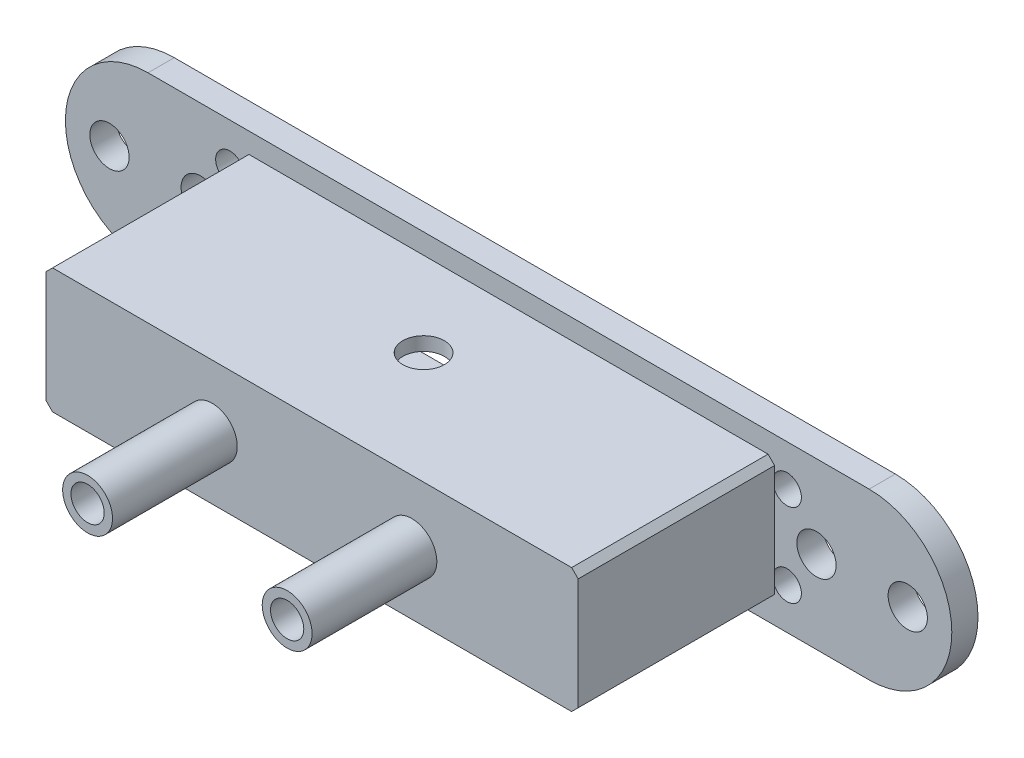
ISO-10303-21;
HEADER;
FILE_DESCRIPTION(('STEP AP214'),'2;1');
FILE_NAME('part.step','',(''),(''),'','','');
FILE_SCHEMA(('AUTOMOTIVE_DESIGN { 1 0 10303 214 1 1 1 1 }'));
ENDSEC;
DATA;
#1=APPLICATION_CONTEXT('core data for automotive mechanical design processes');
#2=APPLICATION_PROTOCOL_DEFINITION('international standard','automotive_design',2000,#1);
#3=PRODUCT_CONTEXT('',#1,'mechanical');
#4=PRODUCT('Part','Part','',(#3));
#5=PRODUCT_RELATED_PRODUCT_CATEGORY('part','',(#4));
#6=PRODUCT_DEFINITION_FORMATION('','',#4);
#7=PRODUCT_DEFINITION_CONTEXT('part definition',#1,'design');
#8=PRODUCT_DEFINITION('design','',#6,#7);
#9=PRODUCT_DEFINITION_SHAPE('','',#8);
#10=(LENGTH_UNIT() NAMED_UNIT(*) SI_UNIT(.MILLI.,.METRE.));
#11=(NAMED_UNIT(*) PLANE_ANGLE_UNIT() SI_UNIT($,.RADIAN.));
#12=(NAMED_UNIT(*) SI_UNIT($,.STERADIAN.) SOLID_ANGLE_UNIT());
#13=UNCERTAINTY_MEASURE_WITH_UNIT(LENGTH_MEASURE(1.E-05),#10,'distance_accuracy_value','');
#14=(GEOMETRIC_REPRESENTATION_CONTEXT(3) GLOBAL_UNCERTAINTY_ASSIGNED_CONTEXT((#13)) GLOBAL_UNIT_ASSIGNED_CONTEXT((#10,
#11,#12)) REPRESENTATION_CONTEXT('',''));
#15=CARTESIAN_POINT('',(0.,0.,0.));
#16=DIRECTION('',(0.,0.,1.));
#17=DIRECTION('',(1.,0.,0.));
#18=AXIS2_PLACEMENT_3D('',#15,#16,#17);
#19=CARTESIAN_POINT('',(-20.32,-4.7625,17.));
#20=DIRECTION('',(0.,0.,1.));
#21=DIRECTION('',(1.,0.,0.));
#22=AXIS2_PLACEMENT_3D('',#19,#20,#21);
#23=PLANE('',#22);
#24=CARTESIAN_POINT('',(7.62,0.,17.));
#25=DIRECTION('',(0.,0.,1.));
#26=DIRECTION('',(1.,0.,0.));
#27=AXIS2_PLACEMENT_3D('',#24,#25,#26);
#28=CIRCLE('',#27,1.905);
#29=CARTESIAN_POINT('',(5.715,0.,17.));
#30=VERTEX_POINT('',#29);
#31=EDGE_CURVE('E459',#30,#30,#28,.T.);
#32=ORIENTED_EDGE('',*,*,#31,.F.);
#33=EDGE_LOOP('',(#32));
#34=FACE_BOUND('',#33,.T.);
#35=DIRECTION('',(0.,-1.,0.));
#36=VECTOR('',#35,1.);
#37=CARTESIAN_POINT('',(-20.32,4.7625,17.));
#38=LINE('',#37,#36);
#39=CARTESIAN_POINT('',(-20.32,4.26250000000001,17.));
#40=VERTEX_POINT('',#39);
#41=CARTESIAN_POINT('',(-20.32,-4.2625,17.));
#42=VERTEX_POINT('',#41);
#43=EDGE_CURVE('E271',#40,#42,#38,.T.);
#44=ORIENTED_EDGE('',*,*,#43,.T.);
#45=DIRECTION('',(-0.707106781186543,0.707106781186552,0.));
#46=VECTOR('',#45,1.);
#47=CARTESIAN_POINT('',(-20.07,-4.5125,17.));
#48=LINE('',#47,#46);
#49=CARTESIAN_POINT('',(-19.82,-4.7625,17.));
#50=VERTEX_POINT('',#49);
#51=EDGE_CURVE('E100',#42,#50,#48,.F.);
#52=ORIENTED_EDGE('',*,*,#51,.T.);
#53=DIRECTION('',(1.,0.,0.));
#54=VECTOR('',#53,1.);
#55=CARTESIAN_POINT('',(-20.32,-4.7625,17.));
#56=LINE('',#55,#54);
#57=CARTESIAN_POINT('',(19.82,-4.7625,17.));
#58=VERTEX_POINT('',#57);
#59=EDGE_CURVE('E274',#50,#58,#56,.T.);
#60=ORIENTED_EDGE('',*,*,#59,.T.);
#61=DIRECTION('',(0.707106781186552,0.707106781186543,0.));
#62=VECTOR('',#61,1.);
#63=CARTESIAN_POINT('',(-0.250000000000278,-24.8325,17.));
#64=LINE('',#63,#62);
#65=CARTESIAN_POINT('',(20.32,-4.2625,17.));
#66=VERTEX_POINT('',#65);
#67=EDGE_CURVE('E366',#58,#66,#64,.T.);
#68=ORIENTED_EDGE('',*,*,#67,.T.);
#69=DIRECTION('',(0.,-1.,0.));
#70=VECTOR('',#69,1.);
#71=CARTESIAN_POINT('',(20.32,4.7625,17.));
#72=LINE('',#71,#70);
#73=CARTESIAN_POINT('',(20.32,4.2625,17.));
#74=VERTEX_POINT('',#73);
#75=EDGE_CURVE('E277',#74,#66,#72,.T.);
#76=ORIENTED_EDGE('',*,*,#75,.F.);
#77=DIRECTION('',(0.707106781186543,-0.707106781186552,0.));
#78=VECTOR('',#77,1.);
#79=CARTESIAN_POINT('',(4.51250000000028,20.0699999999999,17.));
#80=LINE('',#79,#78);
#81=CARTESIAN_POINT('',(19.82,4.7625,17.));
#82=VERTEX_POINT('',#81);
#83=EDGE_CURVE('E356',#74,#82,#80,.F.);
#84=ORIENTED_EDGE('',*,*,#83,.T.);
#85=DIRECTION('',(1.,0.,0.));
#86=VECTOR('',#85,1.);
#87=CARTESIAN_POINT('',(-20.32,4.7625,17.));
#88=LINE('',#87,#86);
#89=CARTESIAN_POINT('',(-19.82,4.7625,17.));
#90=VERTEX_POINT('',#89);
#91=EDGE_CURVE('E279',#90,#82,#88,.T.);
#92=ORIENTED_EDGE('',*,*,#91,.F.);
#93=DIRECTION('',(-0.707106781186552,-0.707106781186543,0.));
#94=VECTOR('',#93,1.);
#95=CARTESIAN_POINT('',(-24.8325,-0.249999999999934,17.));
#96=LINE('',#95,#94);
#97=EDGE_CURVE('E348',#90,#40,#96,.T.);
#98=ORIENTED_EDGE('',*,*,#97,.T.);
#99=EDGE_LOOP('',(#44,#52,#60,#68,#76,#84,#92,#98));
#100=FACE_BOUND('',#99,.T.);
#101=CARTESIAN_POINT('',(-7.62,0.,17.));
#102=DIRECTION('',(0.,0.,1.));
#103=DIRECTION('',(1.,0.,0.));
#104=AXIS2_PLACEMENT_3D('',#101,#102,#103);
#105=CIRCLE('',#104,1.905);
#106=CARTESIAN_POINT('',(-9.525,0.,17.));
#107=VERTEX_POINT('',#106);
#108=EDGE_CURVE('E456',#107,#107,#105,.T.);
#109=ORIENTED_EDGE('',*,*,#108,.F.);
#110=EDGE_LOOP('',(#109));
#111=FACE_BOUND('',#110,.T.);
#112=ADVANCED_FACE('F92',(#34,#100,#111),#23,.T.);
#113=CARTESIAN_POINT('',(-27.5263621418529,0.,0.));
#114=DIRECTION('',(0.,0.,1.));
#115=DIRECTION('',(1.,0.,0.));
#116=AXIS2_PLACEMENT_3D('',#113,#114,#115);
#117=PLANE('',#116);
#118=CARTESIAN_POINT('',(-21.2725,3.175,0.));
#119=DIRECTION('',(0.,0.,1.));
#120=DIRECTION('',(1.,0.,0.));
#121=AXIS2_PLACEMENT_3D('',#118,#119,#120);
#122=CIRCLE('',#121,1.0922);
#123=CARTESIAN_POINT('',(-20.1803,3.175,0.));
#124=VERTEX_POINT('',#123);
#125=EDGE_CURVE('E246',#124,#124,#122,.T.);
#126=ORIENTED_EDGE('',*,*,#125,.T.);
#127=EDGE_LOOP('',(#126));
#128=FACE_BOUND('',#127,.T.);
#129=CARTESIAN_POINT('',(-21.2725,-3.175,0.));
#130=DIRECTION('',(0.,0.,1.));
#131=DIRECTION('',(1.,0.,0.));
#132=AXIS2_PLACEMENT_3D('',#129,#130,#131);
#133=CIRCLE('',#132,1.0922);
#134=CARTESIAN_POINT('',(-20.1803,-3.175,0.));
#135=VERTEX_POINT('',#134);
#136=EDGE_CURVE('E844',#135,#135,#133,.T.);
#137=ORIENTED_EDGE('',*,*,#136,.T.);
#138=EDGE_LOOP('',(#137));
#139=FACE_BOUND('',#138,.T.);
#140=CARTESIAN_POINT('',(21.2725,3.175,0.));
#141=DIRECTION('',(0.,0.,1.));
#142=DIRECTION('',(1.,0.,0.));
#143=AXIS2_PLACEMENT_3D('',#140,#141,#142);
#144=CIRCLE('',#143,1.0922);
#145=CARTESIAN_POINT('',(22.3647,3.175,0.));
#146=VERTEX_POINT('',#145);
#147=EDGE_CURVE('E429',#146,#146,#144,.T.);
#148=ORIENTED_EDGE('',*,*,#147,.T.);
#149=EDGE_LOOP('',(#148));
#150=FACE_BOUND('',#149,.T.);
#151=CARTESIAN_POINT('',(21.2725,-3.175,0.));
#152=DIRECTION('',(0.,0.,1.));
#153=DIRECTION('',(1.,0.,0.));
#154=AXIS2_PLACEMENT_3D('',#151,#152,#153);
#155=CIRCLE('',#154,1.0922);
#156=CARTESIAN_POINT('',(22.3647,-3.175,0.));
#157=VERTEX_POINT('',#156);
#158=EDGE_CURVE('E427',#157,#157,#155,.T.);
#159=ORIENTED_EDGE('',*,*,#158,.T.);
#160=EDGE_LOOP('',(#159));
#161=FACE_BOUND('',#160,.T.);
#162=CARTESIAN_POINT('',(30.4872378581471,0.,0.));
#163=DIRECTION('',(0.,0.,1.));
#164=DIRECTION('',(1.,0.,0.));
#165=AXIS2_PLACEMENT_3D('',#162,#163,#164);
#166=CIRCLE('',#165,1.50000000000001);
#167=CARTESIAN_POINT('',(31.9872378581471,0.,0.));
#168=VERTEX_POINT('',#167);
#169=EDGE_CURVE('E281',#168,#168,#166,.T.);
#170=ORIENTED_EDGE('',*,*,#169,.T.);
#171=EDGE_LOOP('',(#170));
#172=FACE_BOUND('',#171,.T.);
#173=CARTESIAN_POINT('',(-30.4727621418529,0.,0.));
#174=DIRECTION('',(0.,0.,-1.));
#175=DIRECTION('',(-1.,0.,0.));
#176=AXIS2_PLACEMENT_3D('',#173,#174,#175);
#177=CIRCLE('',#176,1.5);
#178=CARTESIAN_POINT('',(-31.9727621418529,0.,0.));
#179=VERTEX_POINT('',#178);
#180=EDGE_CURVE('E292',#179,#179,#177,.T.);
#181=ORIENTED_EDGE('',*,*,#180,.F.);
#182=EDGE_LOOP('',(#181));
#183=FACE_BOUND('',#182,.T.);
#184=CARTESIAN_POINT('',(-23.5059242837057,0.,0.));
#185=DIRECTION('',(0.,0.,1.));
#186=DIRECTION('',(1.,0.,0.));
#187=AXIS2_PLACEMENT_3D('',#184,#185,#186);
#188=CIRCLE('',#187,1.5);
#189=CARTESIAN_POINT('',(-22.0059242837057,0.,0.));
#190=VERTEX_POINT('',#189);
#191=EDGE_CURVE('E305',#190,#190,#188,.T.);
#192=ORIENTED_EDGE('',*,*,#191,.T.);
#193=EDGE_LOOP('',(#192));
#194=FACE_BOUND('',#193,.T.);
#195=CARTESIAN_POINT('',(-27.5263621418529,0.,0.));
#196=DIRECTION('',(0.,0.,1.));
#197=DIRECTION('',(1.,0.,0.));
#198=AXIS2_PLACEMENT_3D('',#195,#196,#197);
#199=CIRCLE('',#198,6.3119);
#200=CARTESIAN_POINT('',(-27.5263621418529,6.3119,0.));
#201=VERTEX_POINT('',#200);
#202=CARTESIAN_POINT('',(-27.5263621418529,-6.3119,0.));
#203=VERTEX_POINT('',#202);
#204=EDGE_CURVE('E311',#201,#203,#199,.T.);
#205=ORIENTED_EDGE('',*,*,#204,.F.);
#206=DIRECTION('',(1.,0.,0.));
#207=VECTOR('',#206,1.);
#208=CARTESIAN_POINT('',(-27.5263621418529,6.3119,0.));
#209=LINE('',#208,#207);
#210=CARTESIAN_POINT('',(27.5408371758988,6.3119,0.));
#211=VERTEX_POINT('',#210);
#212=EDGE_CURVE('E318',#201,#211,#209,.T.);
#213=ORIENTED_EDGE('',*,*,#212,.T.);
#214=CARTESIAN_POINT('',(27.5408378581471,0.,0.));
#215=DIRECTION('',(0.,0.,-1.));
#216=DIRECTION('',(-1.,0.,0.));
#217=AXIS2_PLACEMENT_3D('',#214,#215,#216);
#218=CIRCLE('',#217,6.31190000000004);
#219=CARTESIAN_POINT('',(27.5408385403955,-6.3119,0.));
#220=VERTEX_POINT('',#219);
#221=EDGE_CURVE('E332',#211,#220,#218,.T.);
#222=ORIENTED_EDGE('',*,*,#221,.T.);
#223=DIRECTION('',(1.,0.,0.));
#224=VECTOR('',#223,1.);
#225=CARTESIAN_POINT('',(-27.5263621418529,-6.3119,0.));
#226=LINE('',#225,#224);
#227=EDGE_CURVE('E329',#203,#220,#226,.T.);
#228=ORIENTED_EDGE('',*,*,#227,.F.);
#229=EDGE_LOOP('',(#205,#213,#222,#228));
#230=FACE_BOUND('',#229,.T.);
#231=CARTESIAN_POINT('',(23.5204,0.,0.));
#232=DIRECTION('',(0.,0.,1.));
#233=DIRECTION('',(1.,0.,0.));
#234=AXIS2_PLACEMENT_3D('',#231,#232,#233);
#235=CIRCLE('',#234,1.5);
#236=CARTESIAN_POINT('',(25.0204,0.,0.));
#237=VERTEX_POINT('',#236);
#238=EDGE_CURVE('E299',#237,#237,#235,.T.);
#239=ORIENTED_EDGE('',*,*,#238,.T.);
#240=EDGE_LOOP('',(#239));
#241=FACE_BOUND('',#240,.T.);
#242=DIRECTION('',(1.,0.,0.));
#243=VECTOR('',#242,1.);
#244=CARTESIAN_POINT('',(-20.32,3.7211,0.));
#245=LINE('',#244,#243);
#246=CARTESIAN_POINT('',(-19.2786,3.7211,0.));
#247=VERTEX_POINT('',#246);
#248=CARTESIAN_POINT('',(19.2786,3.7211,0.));
#249=VERTEX_POINT('',#248);
#250=EDGE_CURVE('E474',#247,#249,#245,.T.);
#251=ORIENTED_EDGE('',*,*,#250,.F.);
#252=DIRECTION('',(0.,-1.,0.));
#253=VECTOR('',#252,1.);
#254=CARTESIAN_POINT('',(-19.2786,4.7625,0.));
#255=LINE('',#254,#253);
#256=CARTESIAN_POINT('',(-19.2786,-3.7211,0.));
#257=VERTEX_POINT('',#256);
#258=EDGE_CURVE('E465',#247,#257,#255,.T.);
#259=ORIENTED_EDGE('',*,*,#258,.T.);
#260=DIRECTION('',(1.,0.,0.));
#261=VECTOR('',#260,1.);
#262=CARTESIAN_POINT('',(-20.32,-3.7211,0.));
#263=LINE('',#262,#261);
#264=CARTESIAN_POINT('',(19.2786,-3.7211,0.));
#265=VERTEX_POINT('',#264);
#266=EDGE_CURVE('E468',#257,#265,#263,.T.);
#267=ORIENTED_EDGE('',*,*,#266,.T.);
#268=DIRECTION('',(0.,-1.,0.));
#269=VECTOR('',#268,1.);
#270=CARTESIAN_POINT('',(19.2786,4.7625,0.));
#271=LINE('',#270,#269);
#272=EDGE_CURVE('E471',#249,#265,#271,.T.);
#273=ORIENTED_EDGE('',*,*,#272,.F.);
#274=EDGE_LOOP('',(#251,#259,#267,#273));
#275=FACE_BOUND('',#274,.T.);
#276=ADVANCED_FACE('F507',(#128,#139,#150,#161,#172,#183,#194,#230,#241,#275),#117,.F.);
#277=CARTESIAN_POINT('',(-27.5263621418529,0.,2.));
#278=DIRECTION('',(0.,0.,1.));
#279=DIRECTION('',(1.,0.,0.));
#280=AXIS2_PLACEMENT_3D('',#277,#278,#279);
#281=PLANE('',#280);
#282=CARTESIAN_POINT('',(-21.2725,3.175,2.));
#283=DIRECTION('',(0.,0.,1.));
#284=DIRECTION('',(1.,0.,0.));
#285=AXIS2_PLACEMENT_3D('',#282,#283,#284);
#286=CIRCLE('',#285,1.09219999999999);
#287=CARTESIAN_POINT('',(-20.32,3.7094572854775,2.));
#288=VERTEX_POINT('',#287);
#289=CARTESIAN_POINT('',(-20.32,2.64054271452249,2.));
#290=VERTEX_POINT('',#289);
#291=EDGE_CURVE('E106',#288,#290,#286,.T.);
#292=ORIENTED_EDGE('',*,*,#291,.F.);
#293=DIRECTION('',(0.,-1.,0.));
#294=VECTOR('',#293,1.);
#295=CARTESIAN_POINT('',(-20.32,4.7625,2.));
#296=LINE('',#295,#294);
#297=CARTESIAN_POINT('',(-20.32,4.26250000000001,2.));
#298=VERTEX_POINT('',#297);
#299=EDGE_CURVE('E236',#298,#288,#296,.T.);
#300=ORIENTED_EDGE('',*,*,#299,.F.);
#301=DIRECTION('',(0.707106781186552,0.707106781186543,0.));
#302=VECTOR('',#301,1.);
#303=CARTESIAN_POINT('',(-20.32,4.26250000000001,2.));
#304=LINE('',#303,#302);
#305=CARTESIAN_POINT('',(-19.82,4.7625,2.));
#306=VERTEX_POINT('',#305);
#307=EDGE_CURVE('E350',#298,#306,#304,.T.);
#308=ORIENTED_EDGE('',*,*,#307,.T.);
#309=DIRECTION('',(1.,0.,0.));
#310=VECTOR('',#309,1.);
#311=CARTESIAN_POINT('',(-20.32,4.7625,2.));
#312=LINE('',#311,#310);
#313=CARTESIAN_POINT('',(19.82,4.7625,2.));
#314=VERTEX_POINT('',#313);
#315=EDGE_CURVE('E275',#306,#314,#312,.T.);
#316=ORIENTED_EDGE('',*,*,#315,.T.);
#317=DIRECTION('',(-0.707106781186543,0.707106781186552,0.));
#318=VECTOR('',#317,1.);
#319=CARTESIAN_POINT('',(19.82,4.7625,2.));
#320=LINE('',#319,#318);
#321=CARTESIAN_POINT('',(20.32,4.2625,2.));
#322=VERTEX_POINT('',#321);
#323=EDGE_CURVE('E358',#314,#322,#320,.F.);
#324=ORIENTED_EDGE('',*,*,#323,.T.);
#325=DIRECTION('',(0.,-1.,0.));
#326=VECTOR('',#325,1.);
#327=CARTESIAN_POINT('',(20.32,4.7625,2.));
#328=LINE('',#327,#326);
#329=CARTESIAN_POINT('',(20.32,3.7094572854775,2.));
#330=VERTEX_POINT('',#329);
#331=EDGE_CURVE('E401',#322,#330,#328,.T.);
#332=ORIENTED_EDGE('',*,*,#331,.T.);
#333=CARTESIAN_POINT('',(21.2725,3.175,2.));
#334=DIRECTION('',(0.,0.,1.));
#335=DIRECTION('',(1.,0.,0.));
#336=AXIS2_PLACEMENT_3D('',#333,#334,#335);
#337=CIRCLE('',#336,1.09219999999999);
#338=CARTESIAN_POINT('',(20.32,2.64054271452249,2.));
#339=VERTEX_POINT('',#338);
#340=EDGE_CURVE('E846',#339,#330,#337,.T.);
#341=ORIENTED_EDGE('',*,*,#340,.F.);
#342=CARTESIAN_POINT('',(20.32,-2.6405427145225,2.));
#343=VERTEX_POINT('',#342);
#344=EDGE_CURVE('E413',#339,#343,#328,.T.);
#345=ORIENTED_EDGE('',*,*,#344,.T.);
#346=CARTESIAN_POINT('',(21.2725,-3.175,2.));
#347=DIRECTION('',(0.,0.,1.));
#348=DIRECTION('',(1.,0.,0.));
#349=AXIS2_PLACEMENT_3D('',#346,#347,#348);
#350=CIRCLE('',#349,1.09219999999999);
#351=CARTESIAN_POINT('',(20.32,-3.70945728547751,2.));
#352=VERTEX_POINT('',#351);
#353=EDGE_CURVE('E426',#352,#343,#350,.T.);
#354=ORIENTED_EDGE('',*,*,#353,.F.);
#355=CARTESIAN_POINT('',(20.32,-4.2625,2.));
#356=VERTEX_POINT('',#355);
#357=EDGE_CURVE('E254',#352,#356,#328,.T.);
#358=ORIENTED_EDGE('',*,*,#357,.T.);
#359=DIRECTION('',(-0.707106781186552,-0.707106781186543,0.));
#360=VECTOR('',#359,1.);
#361=CARTESIAN_POINT('',(20.32,-4.26250000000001,2.));
#362=LINE('',#361,#360);
#363=CARTESIAN_POINT('',(19.82,-4.7625,2.));
#364=VERTEX_POINT('',#363);
#365=EDGE_CURVE('E368',#356,#364,#362,.T.);
#366=ORIENTED_EDGE('',*,*,#365,.T.);
#367=DIRECTION('',(1.,0.,0.));
#368=VECTOR('',#367,1.);
#369=CARTESIAN_POINT('',(-20.32,-4.7625,2.));
#370=LINE('',#369,#368);
#371=CARTESIAN_POINT('',(-19.82,-4.7625,2.));
#372=VERTEX_POINT('',#371);
#373=EDGE_CURVE('E252',#372,#364,#370,.T.);
#374=ORIENTED_EDGE('',*,*,#373,.F.);
#375=DIRECTION('',(0.707106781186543,-0.707106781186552,0.));
#376=VECTOR('',#375,1.);
#377=CARTESIAN_POINT('',(-19.82,-4.7625,2.));
#378=LINE('',#377,#376);
#379=CARTESIAN_POINT('',(-20.32,-4.2625,2.));
#380=VERTEX_POINT('',#379);
#381=EDGE_CURVE('E12',#372,#380,#378,.F.);
#382=ORIENTED_EDGE('',*,*,#381,.T.);
#383=CARTESIAN_POINT('',(-20.32,-3.70945728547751,2.));
#384=VERTEX_POINT('',#383);
#385=EDGE_CURVE('E239',#384,#380,#296,.T.);
#386=ORIENTED_EDGE('',*,*,#385,.F.);
#387=CARTESIAN_POINT('',(-21.2725,-3.175,2.));
#388=DIRECTION('',(0.,0.,1.));
#389=DIRECTION('',(1.,0.,0.));
#390=AXIS2_PLACEMENT_3D('',#387,#388,#389);
#391=CIRCLE('',#390,1.09219999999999);
#392=CARTESIAN_POINT('',(-20.32,-2.6405427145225,2.));
#393=VERTEX_POINT('',#392);
#394=EDGE_CURVE('E113',#393,#384,#391,.T.);
#395=ORIENTED_EDGE('',*,*,#394,.F.);
#396=EDGE_CURVE('E237',#290,#393,#296,.T.);
#397=ORIENTED_EDGE('',*,*,#396,.F.);
#398=EDGE_LOOP('',(#292,#300,#308,#316,#324,#332,#341,#345,#354,#358,#366,#374,#382,#386,#395,#397));
#399=FACE_BOUND('',#398,.T.);
#400=CARTESIAN_POINT('',(30.4872378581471,0.,2.));
#401=DIRECTION('',(0.,0.,1.));
#402=DIRECTION('',(1.,0.,0.));
#403=AXIS2_PLACEMENT_3D('',#400,#401,#402);
#404=CIRCLE('',#403,1.50000000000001);
#405=CARTESIAN_POINT('',(31.9872378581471,0.,2.));
#406=VERTEX_POINT('',#405);
#407=EDGE_CURVE('E287',#406,#406,#404,.T.);
#408=ORIENTED_EDGE('',*,*,#407,.F.);
#409=EDGE_LOOP('',(#408));
#410=FACE_BOUND('',#409,.T.);
#411=CARTESIAN_POINT('',(-30.4727621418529,0.,2.));
#412=DIRECTION('',(0.,0.,-1.));
#413=DIRECTION('',(-1.,0.,0.));
#414=AXIS2_PLACEMENT_3D('',#411,#412,#413);
#415=CIRCLE('',#414,1.5);
#416=CARTESIAN_POINT('',(-31.9727621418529,0.,2.));
#417=VERTEX_POINT('',#416);
#418=EDGE_CURVE('E296',#417,#417,#415,.T.);
#419=ORIENTED_EDGE('',*,*,#418,.T.);
#420=EDGE_LOOP('',(#419));
#421=FACE_BOUND('',#420,.T.);
#422=CARTESIAN_POINT('',(-23.5059242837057,0.,2.));
#423=DIRECTION('',(0.,0.,1.));
#424=DIRECTION('',(1.,0.,0.));
#425=AXIS2_PLACEMENT_3D('',#422,#423,#424);
#426=CIRCLE('',#425,1.5);
#427=CARTESIAN_POINT('',(-22.0059242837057,0.,2.));
#428=VERTEX_POINT('',#427);
#429=EDGE_CURVE('E308',#428,#428,#426,.T.);
#430=ORIENTED_EDGE('',*,*,#429,.F.);
#431=EDGE_LOOP('',(#430));
#432=FACE_BOUND('',#431,.T.);
#433=CARTESIAN_POINT('',(-27.5263621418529,0.,2.));
#434=DIRECTION('',(0.,0.,1.));
#435=DIRECTION('',(1.,0.,0.));
#436=AXIS2_PLACEMENT_3D('',#433,#434,#435);
#437=CIRCLE('',#436,6.3119);
#438=CARTESIAN_POINT('',(-27.5263621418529,6.3119,2.));
#439=VERTEX_POINT('',#438);
#440=CARTESIAN_POINT('',(-27.5263621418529,-6.3119,2.));
#441=VERTEX_POINT('',#440);
#442=EDGE_CURVE('E314',#439,#441,#437,.T.);
#443=ORIENTED_EDGE('',*,*,#442,.T.);
#444=DIRECTION('',(1.,0.,0.));
#445=VECTOR('',#444,1.);
#446=CARTESIAN_POINT('',(-27.5263621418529,-6.3119,2.));
#447=LINE('',#446,#445);
#448=CARTESIAN_POINT('',(27.5408385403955,-6.3119,2.));
#449=VERTEX_POINT('',#448);
#450=EDGE_CURVE('E317',#441,#449,#447,.T.);
#451=ORIENTED_EDGE('',*,*,#450,.T.);
#452=CARTESIAN_POINT('',(27.5408378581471,0.,2.));
#453=DIRECTION('',(0.,0.,-1.));
#454=DIRECTION('',(-1.,0.,0.));
#455=AXIS2_PLACEMENT_3D('',#452,#453,#454);
#456=CIRCLE('',#455,6.31190000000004);
#457=CARTESIAN_POINT('',(27.5408371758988,6.3119,2.));
#458=VERTEX_POINT('',#457);
#459=EDGE_CURVE('E320',#458,#449,#456,.T.);
#460=ORIENTED_EDGE('',*,*,#459,.F.);
#461=DIRECTION('',(1.,0.,0.));
#462=VECTOR('',#461,1.);
#463=CARTESIAN_POINT('',(-27.5263621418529,6.3119,2.));
#464=LINE('',#463,#462);
#465=EDGE_CURVE('E323',#439,#458,#464,.T.);
#466=ORIENTED_EDGE('',*,*,#465,.F.);
#467=EDGE_LOOP('',(#443,#451,#460,#466));
#468=FACE_BOUND('',#467,.T.);
#469=CARTESIAN_POINT('',(23.5204,0.,2.));
#470=DIRECTION('',(0.,0.,1.));
#471=DIRECTION('',(1.,0.,0.));
#472=AXIS2_PLACEMENT_3D('',#469,#470,#471);
#473=CIRCLE('',#472,1.5);
#474=CARTESIAN_POINT('',(25.0204,0.,2.));
#475=VERTEX_POINT('',#474);
#476=EDGE_CURVE('E302',#475,#475,#473,.T.);
#477=ORIENTED_EDGE('',*,*,#476,.F.);
#478=EDGE_LOOP('',(#477));
#479=FACE_BOUND('',#478,.T.);
#480=ADVANCED_FACE('F244',(#399,#410,#421,#432,#468,#479),#281,.T.);
#481=CARTESIAN_POINT('',(-27.5263621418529,0.,2.));
#482=DIRECTION('',(0.,0.,-1.));
#483=DIRECTION('',(-1.,0.,0.));
#484=AXIS2_PLACEMENT_3D('',#481,#482,#483);
#485=CYLINDRICAL_SURFACE('',#484,6.3119);
#486=ORIENTED_EDGE('',*,*,#204,.T.);
#487=DIRECTION('',(0.,0.,-1.));
#488=VECTOR('',#487,1.);
#489=CARTESIAN_POINT('',(-27.5263621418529,-6.3119,2.));
#490=LINE('',#489,#488);
#491=EDGE_CURVE('E342',#441,#203,#490,.T.);
#492=ORIENTED_EDGE('',*,*,#491,.F.);
#493=ORIENTED_EDGE('',*,*,#442,.F.);
#494=DIRECTION('',(0.,0.,-1.));
#495=VECTOR('',#494,1.);
#496=CARTESIAN_POINT('',(-27.5263621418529,6.3119,2.));
#497=LINE('',#496,#495);
#498=EDGE_CURVE('E326',#439,#201,#497,.T.);
#499=ORIENTED_EDGE('',*,*,#498,.T.);
#500=EDGE_LOOP('',(#486,#492,#493,#499));
#501=FACE_BOUND('',#500,.T.);
#502=ADVANCED_FACE('F515',(#501),#485,.T.);
#503=CARTESIAN_POINT('',(-27.5263621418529,-6.3119,2.));
#504=DIRECTION('',(0.,1.,0.));
#505=DIRECTION('',(0.,0.,1.));
#506=AXIS2_PLACEMENT_3D('',#503,#504,#505);
#507=PLANE('',#506);
#508=ORIENTED_EDGE('',*,*,#227,.T.);
#509=DIRECTION('',(0.,0.,-1.));
#510=VECTOR('',#509,1.);
#511=CARTESIAN_POINT('',(27.5408385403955,-6.3119,2.));
#512=LINE('',#511,#510);
#513=EDGE_CURVE('E340',#449,#220,#512,.T.);
#514=ORIENTED_EDGE('',*,*,#513,.F.);
#515=ORIENTED_EDGE('',*,*,#450,.F.);
#516=ORIENTED_EDGE('',*,*,#491,.T.);
#517=EDGE_LOOP('',(#508,#514,#515,#516));
#518=FACE_BOUND('',#517,.T.);
#519=ADVANCED_FACE('F531',(#518),#507,.F.);
#520=CARTESIAN_POINT('',(27.5408378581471,0.,2.));
#521=DIRECTION('',(0.,0.,-1.));
#522=DIRECTION('',(-1.,0.,0.));
#523=AXIS2_PLACEMENT_3D('',#520,#521,#522);
#524=CYLINDRICAL_SURFACE('',#523,6.31190000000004);
#525=ORIENTED_EDGE('',*,*,#221,.F.);
#526=DIRECTION('',(0.,0.,-1.));
#527=VECTOR('',#526,1.);
#528=CARTESIAN_POINT('',(27.5408371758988,6.3119,2.));
#529=LINE('',#528,#527);
#530=EDGE_CURVE('E338',#458,#211,#529,.T.);
#531=ORIENTED_EDGE('',*,*,#530,.F.);
#532=ORIENTED_EDGE('',*,*,#459,.T.);
#533=ORIENTED_EDGE('',*,*,#513,.T.);
#534=EDGE_LOOP('',(#525,#531,#532,#533));
#535=FACE_BOUND('',#534,.T.);
#536=ADVANCED_FACE('F527',(#535),#524,.T.);
#537=CARTESIAN_POINT('',(-27.5263621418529,6.3119,2.));
#538=DIRECTION('',(0.,1.,0.));
#539=DIRECTION('',(0.,0.,1.));
#540=AXIS2_PLACEMENT_3D('',#537,#538,#539);
#541=PLANE('',#540);
#542=ORIENTED_EDGE('',*,*,#212,.F.);
#543=ORIENTED_EDGE('',*,*,#498,.F.);
#544=ORIENTED_EDGE('',*,*,#465,.T.);
#545=ORIENTED_EDGE('',*,*,#530,.T.);
#546=EDGE_LOOP('',(#542,#543,#544,#545));
#547=FACE_BOUND('',#546,.T.);
#548=ADVANCED_FACE('F523',(#547),#541,.T.);
#549=CARTESIAN_POINT('',(-23.5059242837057,0.,2.));
#550=DIRECTION('',(0.,0.,-1.));
#551=DIRECTION('',(-1.,0.,0.));
#552=AXIS2_PLACEMENT_3D('',#549,#550,#551);
#553=CYLINDRICAL_SURFACE('',#552,1.5);
#554=ORIENTED_EDGE('',*,*,#429,.T.);
#555=EDGE_LOOP('',(#554));
#556=FACE_BOUND('',#555,.T.);
#557=ORIENTED_EDGE('',*,*,#191,.F.);
#558=EDGE_LOOP('',(#557));
#559=FACE_BOUND('',#558,.T.);
#560=ADVANCED_FACE('F526',(#556,#559),#553,.F.);
#561=CARTESIAN_POINT('',(23.5204,0.,2.));
#562=DIRECTION('',(0.,0.,-1.));
#563=DIRECTION('',(-1.,0.,0.));
#564=AXIS2_PLACEMENT_3D('',#561,#562,#563);
#565=CYLINDRICAL_SURFACE('',#564,1.5);
#566=ORIENTED_EDGE('',*,*,#476,.T.);
#567=EDGE_LOOP('',(#566));
#568=FACE_BOUND('',#567,.T.);
#569=ORIENTED_EDGE('',*,*,#238,.F.);
#570=EDGE_LOOP('',(#569));
#571=FACE_BOUND('',#570,.T.);
#572=ADVANCED_FACE('F582',(#568,#571),#565,.F.);
#573=CARTESIAN_POINT('',(-30.4727621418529,0.,2.));
#574=DIRECTION('',(0.,0.,-1.));
#575=DIRECTION('',(-1.,0.,0.));
#576=AXIS2_PLACEMENT_3D('',#573,#574,#575);
#577=CYLINDRICAL_SURFACE('',#576,1.5);
#578=ORIENTED_EDGE('',*,*,#418,.F.);
#579=EDGE_LOOP('',(#578));
#580=FACE_BOUND('',#579,.T.);
#581=ORIENTED_EDGE('',*,*,#180,.T.);
#582=EDGE_LOOP('',(#581));
#583=FACE_BOUND('',#582,.T.);
#584=ADVANCED_FACE('F578',(#580,#583),#577,.F.);
#585=CARTESIAN_POINT('',(30.4872378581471,0.,2.));
#586=DIRECTION('',(0.,0.,-1.));
#587=DIRECTION('',(-1.,0.,0.));
#588=AXIS2_PLACEMENT_3D('',#585,#586,#587);
#589=CYLINDRICAL_SURFACE('',#588,1.50000000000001);
#590=ORIENTED_EDGE('',*,*,#407,.T.);
#591=EDGE_LOOP('',(#590));
#592=FACE_BOUND('',#591,.T.);
#593=ORIENTED_EDGE('',*,*,#169,.F.);
#594=EDGE_LOOP('',(#593));
#595=FACE_BOUND('',#594,.T.);
#596=ADVANCED_FACE('F575',(#592,#595),#589,.F.);
#597=CARTESIAN_POINT('',(-20.32,4.7625,17.));
#598=DIRECTION('',(1.,0.,0.));
#599=DIRECTION('',(0.,0.,-1.));
#600=AXIS2_PLACEMENT_3D('',#597,#598,#599);
#601=PLANE('',#600);
#602=ORIENTED_EDGE('',*,*,#299,.T.);
#603=EDGE_CURVE('E230',#288,#290,#296,.T.);
#604=ORIENTED_EDGE('',*,*,#603,.T.);
#605=ORIENTED_EDGE('',*,*,#396,.T.);
#606=EDGE_CURVE('E253',#393,#384,#296,.T.);
#607=ORIENTED_EDGE('',*,*,#606,.T.);
#608=ORIENTED_EDGE('',*,*,#385,.T.);
#609=DIRECTION('',(0.,0.,1.));
#610=VECTOR('',#609,1.);
#611=CARTESIAN_POINT('',(-20.32,-4.2625,17.));
#612=LINE('',#611,#610);
#613=EDGE_CURVE('E374',#380,#42,#612,.T.);
#614=ORIENTED_EDGE('',*,*,#613,.T.);
#615=ORIENTED_EDGE('',*,*,#43,.F.);
#616=DIRECTION('',(0.,0.,-1.));
#617=VECTOR('',#616,1.);
#618=CARTESIAN_POINT('',(-20.32,4.26250000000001,2.));
#619=LINE('',#618,#617);
#620=EDGE_CURVE('E251',#40,#298,#619,.T.);
#621=ORIENTED_EDGE('',*,*,#620,.T.);
#622=EDGE_LOOP('',(#602,#604,#605,#607,#608,#614,#615,#621));
#623=FACE_BOUND('',#622,.T.);
#624=ADVANCED_FACE('F248',(#623),#601,.F.);
#625=CARTESIAN_POINT('',(-20.32,-4.7625,17.));
#626=DIRECTION('',(0.,1.,0.));
#627=DIRECTION('',(0.,0.,1.));
#628=AXIS2_PLACEMENT_3D('',#625,#626,#627);
#629=PLANE('',#628);
#630=ORIENTED_EDGE('',*,*,#59,.F.);
#631=DIRECTION('',(0.,0.,-1.));
#632=VECTOR('',#631,1.);
#633=CARTESIAN_POINT('',(-19.82,-4.7625,17.));
#634=LINE('',#633,#632);
#635=EDGE_CURVE('E371',#50,#372,#634,.T.);
#636=ORIENTED_EDGE('',*,*,#635,.T.);
#637=ORIENTED_EDGE('',*,*,#373,.T.);
#638=DIRECTION('',(0.,0.,1.));
#639=VECTOR('',#638,1.);
#640=CARTESIAN_POINT('',(19.82,-4.7625,17.));
#641=LINE('',#640,#639);
#642=EDGE_CURVE('E363',#364,#58,#641,.T.);
#643=ORIENTED_EDGE('',*,*,#642,.T.);
#644=EDGE_LOOP('',(#630,#636,#637,#643));
#645=FACE_BOUND('',#644,.T.);
#646=ADVANCED_FACE('F383',(#645),#629,.F.);
#647=CARTESIAN_POINT('',(20.32,4.7625,17.));
#648=DIRECTION('',(1.,0.,0.));
#649=DIRECTION('',(0.,0.,-1.));
#650=AXIS2_PLACEMENT_3D('',#647,#648,#649);
#651=PLANE('',#650);
#652=ORIENTED_EDGE('',*,*,#75,.T.);
#653=DIRECTION('',(0.,0.,-1.));
#654=VECTOR('',#653,1.);
#655=CARTESIAN_POINT('',(20.32,-4.26250000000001,2.));
#656=LINE('',#655,#654);
#657=EDGE_CURVE('E360',#66,#356,#656,.T.);
#658=ORIENTED_EDGE('',*,*,#657,.T.);
#659=ORIENTED_EDGE('',*,*,#357,.F.);
#660=EDGE_CURVE('E414',#343,#352,#328,.T.);
#661=ORIENTED_EDGE('',*,*,#660,.F.);
#662=ORIENTED_EDGE('',*,*,#344,.F.);
#663=EDGE_CURVE('E411',#330,#339,#328,.T.);
#664=ORIENTED_EDGE('',*,*,#663,.F.);
#665=ORIENTED_EDGE('',*,*,#331,.F.);
#666=DIRECTION('',(0.,0.,1.));
#667=VECTOR('',#666,1.);
#668=CARTESIAN_POINT('',(20.32,4.2625,17.));
#669=LINE('',#668,#667);
#670=EDGE_CURVE('E354',#322,#74,#669,.T.);
#671=ORIENTED_EDGE('',*,*,#670,.T.);
#672=EDGE_LOOP('',(#652,#658,#659,#661,#662,#664,#665,#671));
#673=FACE_BOUND('',#672,.T.);
#674=ADVANCED_FACE('F396',(#673),#651,.T.);
#675=CARTESIAN_POINT('',(-20.32,4.7625,17.));
#676=DIRECTION('',(0.,1.,0.));
#677=DIRECTION('',(0.,0.,1.));
#678=AXIS2_PLACEMENT_3D('',#675,#676,#677);
#679=PLANE('',#678);
#680=CARTESIAN_POINT('',(-0.0457049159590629,4.7625,8.44091814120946));
#681=DIRECTION('',(0.,1.,0.));
#682=DIRECTION('',(0.,0.,1.));
#683=AXIS2_PLACEMENT_3D('',#680,#681,#682);
#684=CIRCLE('',#683,1.5875);
#685=CARTESIAN_POINT('',(-0.0457049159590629,4.7625,10.0284181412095));
#686=VERTEX_POINT('',#685);
#687=EDGE_CURVE('E437',#686,#686,#684,.T.);
#688=ORIENTED_EDGE('',*,*,#687,.F.);
#689=EDGE_LOOP('',(#688));
#690=FACE_BOUND('',#689,.T.);
#691=ORIENTED_EDGE('',*,*,#91,.T.);
#692=DIRECTION('',(0.,0.,-1.));
#693=VECTOR('',#692,1.);
#694=CARTESIAN_POINT('',(19.82,4.7625,17.));
#695=LINE('',#694,#693);
#696=EDGE_CURVE('E352',#82,#314,#695,.T.);
#697=ORIENTED_EDGE('',*,*,#696,.T.);
#698=ORIENTED_EDGE('',*,*,#315,.F.);
#699=DIRECTION('',(0.,0.,1.));
#700=VECTOR('',#699,1.);
#701=CARTESIAN_POINT('',(-19.82,4.7625,17.));
#702=LINE('',#701,#700);
#703=EDGE_CURVE('E346',#306,#90,#702,.T.);
#704=ORIENTED_EDGE('',*,*,#703,.T.);
#705=EDGE_LOOP('',(#691,#697,#698,#704));
#706=FACE_BOUND('',#705,.T.);
#707=ADVANCED_FACE('F410',(#690,#706),#679,.T.);
#708=CARTESIAN_POINT('',(-20.32,4.26250000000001,17.));
#709=DIRECTION('',(-0.707106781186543,0.707106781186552,0.));
#710=DIRECTION('',(-0.707106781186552,-0.707106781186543,0.));
#711=AXIS2_PLACEMENT_3D('',#708,#709,#710);
#712=PLANE('',#711);
#713=ORIENTED_EDGE('',*,*,#97,.F.);
#714=ORIENTED_EDGE('',*,*,#703,.F.);
#715=ORIENTED_EDGE('',*,*,#307,.F.);
#716=ORIENTED_EDGE('',*,*,#620,.F.);
#717=EDGE_LOOP('',(#713,#714,#715,#716));
#718=FACE_BOUND('',#717,.T.);
#719=ADVANCED_FACE('F407',(#718),#712,.T.);
#720=CARTESIAN_POINT('',(19.82,4.7625,17.));
#721=DIRECTION('',(-0.707106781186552,-0.707106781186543,0.));
#722=DIRECTION('',(0.707106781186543,-0.707106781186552,0.));
#723=AXIS2_PLACEMENT_3D('',#720,#721,#722);
#724=PLANE('',#723);
#725=ORIENTED_EDGE('',*,*,#83,.F.);
#726=ORIENTED_EDGE('',*,*,#670,.F.);
#727=ORIENTED_EDGE('',*,*,#323,.F.);
#728=ORIENTED_EDGE('',*,*,#696,.F.);
#729=EDGE_LOOP('',(#725,#726,#727,#728));
#730=FACE_BOUND('',#729,.T.);
#731=ADVANCED_FACE('F403',(#730),#724,.F.);
#732=CARTESIAN_POINT('',(20.32,-4.26250000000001,17.));
#733=DIRECTION('',(0.707106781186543,-0.707106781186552,0.));
#734=DIRECTION('',(0.707106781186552,0.707106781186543,0.));
#735=AXIS2_PLACEMENT_3D('',#732,#733,#734);
#736=PLANE('',#735);
#737=ORIENTED_EDGE('',*,*,#67,.F.);
#738=ORIENTED_EDGE('',*,*,#642,.F.);
#739=ORIENTED_EDGE('',*,*,#365,.F.);
#740=ORIENTED_EDGE('',*,*,#657,.F.);
#741=EDGE_LOOP('',(#737,#738,#739,#740));
#742=FACE_BOUND('',#741,.T.);
#743=ADVANCED_FACE('F392',(#742),#736,.T.);
#744=CARTESIAN_POINT('',(-19.82,-4.7625,17.));
#745=DIRECTION('',(0.707106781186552,0.707106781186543,0.));
#746=DIRECTION('',(-0.707106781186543,0.707106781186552,0.));
#747=AXIS2_PLACEMENT_3D('',#744,#745,#746);
#748=PLANE('',#747);
#749=ORIENTED_EDGE('',*,*,#51,.F.);
#750=ORIENTED_EDGE('',*,*,#613,.F.);
#751=ORIENTED_EDGE('',*,*,#381,.F.);
#752=ORIENTED_EDGE('',*,*,#635,.F.);
#753=EDGE_LOOP('',(#749,#750,#751,#752));
#754=FACE_BOUND('',#753,.T.);
#755=ADVANCED_FACE('F94',(#754),#748,.F.);
#756=CARTESIAN_POINT('',(-19.2786,4.7625,17.));
#757=DIRECTION('',(1.,0.,0.));
#758=DIRECTION('',(0.,0.,-1.));
#759=AXIS2_PLACEMENT_3D('',#756,#757,#758);
#760=PLANE('',#759);
#761=DIRECTION('',(0.,0.,1.));
#762=VECTOR('',#761,1.);
#763=CARTESIAN_POINT('',(-19.2786,3.7211,17.));
#764=LINE('',#763,#762);
#765=CARTESIAN_POINT('',(-19.2786,3.7211,15.9586));
#766=VERTEX_POINT('',#765);
#767=EDGE_CURVE('E267',#247,#766,#764,.T.);
#768=ORIENTED_EDGE('',*,*,#767,.T.);
#769=DIRECTION('',(0.,-1.,0.));
#770=VECTOR('',#769,1.);
#771=CARTESIAN_POINT('',(-19.2786,4.7625,15.9586));
#772=LINE('',#771,#770);
#773=CARTESIAN_POINT('',(-19.2786,-3.7211,15.9586));
#774=VERTEX_POINT('',#773);
#775=EDGE_CURVE('E476',#766,#774,#772,.T.);
#776=ORIENTED_EDGE('',*,*,#775,.T.);
#777=DIRECTION('',(0.,0.,-1.));
#778=VECTOR('',#777,1.);
#779=CARTESIAN_POINT('',(-19.2786,-3.7211,17.));
#780=LINE('',#779,#778);
#781=EDGE_CURVE('E489',#774,#257,#780,.T.);
#782=ORIENTED_EDGE('',*,*,#781,.T.);
#783=ORIENTED_EDGE('',*,*,#258,.F.);
#784=EDGE_LOOP('',(#768,#776,#782,#783));
#785=FACE_BOUND('',#784,.T.);
#786=ADVANCED_FACE('F493',(#785),#760,.T.);
#787=CARTESIAN_POINT('',(-20.32,-3.7211,17.));
#788=DIRECTION('',(0.,1.,0.));
#789=DIRECTION('',(0.,0.,1.));
#790=AXIS2_PLACEMENT_3D('',#787,#788,#789);
#791=PLANE('',#790);
#792=ORIENTED_EDGE('',*,*,#266,.F.);
#793=ORIENTED_EDGE('',*,*,#781,.F.);
#794=DIRECTION('',(1.,0.,0.));
#795=VECTOR('',#794,1.);
#796=CARTESIAN_POINT('',(-20.32,-3.7211,15.9586));
#797=LINE('',#796,#795);
#798=CARTESIAN_POINT('',(19.2786,-3.7211,15.9586));
#799=VERTEX_POINT('',#798);
#800=EDGE_CURVE('E480',#774,#799,#797,.T.);
#801=ORIENTED_EDGE('',*,*,#800,.T.);
#802=DIRECTION('',(0.,0.,1.));
#803=VECTOR('',#802,1.);
#804=CARTESIAN_POINT('',(19.2786,-3.7211,17.));
#805=LINE('',#804,#803);
#806=EDGE_CURVE('E262',#265,#799,#805,.T.);
#807=ORIENTED_EDGE('',*,*,#806,.F.);
#808=EDGE_LOOP('',(#792,#793,#801,#807));
#809=FACE_BOUND('',#808,.T.);
#810=ADVANCED_FACE('F505',(#809),#791,.T.);
#811=CARTESIAN_POINT('',(19.2786,4.7625,17.));
#812=DIRECTION('',(1.,0.,0.));
#813=DIRECTION('',(0.,0.,-1.));
#814=AXIS2_PLACEMENT_3D('',#811,#812,#813);
#815=PLANE('',#814);
#816=DIRECTION('',(0.,0.,-1.));
#817=VECTOR('',#816,1.);
#818=CARTESIAN_POINT('',(19.2786,3.7211,17.));
#819=LINE('',#818,#817);
#820=CARTESIAN_POINT('',(19.2786,3.7211,15.9586));
#821=VERTEX_POINT('',#820);
#822=EDGE_CURVE('E259',#821,#249,#819,.T.);
#823=ORIENTED_EDGE('',*,*,#822,.T.);
#824=ORIENTED_EDGE('',*,*,#272,.T.);
#825=ORIENTED_EDGE('',*,*,#806,.T.);
#826=DIRECTION('',(0.,-1.,0.));
#827=VECTOR('',#826,1.);
#828=CARTESIAN_POINT('',(19.2786,4.7625,15.9586));
#829=LINE('',#828,#827);
#830=EDGE_CURVE('E483',#821,#799,#829,.T.);
#831=ORIENTED_EDGE('',*,*,#830,.F.);
#832=EDGE_LOOP('',(#823,#824,#825,#831));
#833=FACE_BOUND('',#832,.T.);
#834=ADVANCED_FACE('F501',(#833),#815,.F.);
#835=CARTESIAN_POINT('',(-20.32,3.7211,17.));
#836=DIRECTION('',(0.,1.,0.));
#837=DIRECTION('',(0.,0.,1.));
#838=AXIS2_PLACEMENT_3D('',#835,#836,#837);
#839=PLANE('',#838);
#840=CARTESIAN_POINT('',(-0.0457049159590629,3.7211,8.44091814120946));
#841=DIRECTION('',(0.,1.,0.));
#842=DIRECTION('',(0.,0.,1.));
#843=AXIS2_PLACEMENT_3D('',#840,#841,#842);
#844=CIRCLE('',#843,1.5875);
#845=CARTESIAN_POINT('',(-0.0457049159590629,3.7211,10.0284181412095));
#846=VERTEX_POINT('',#845);
#847=EDGE_CURVE('E440',#846,#846,#844,.F.);
#848=ORIENTED_EDGE('',*,*,#847,.F.);
#849=EDGE_LOOP('',(#848));
#850=FACE_BOUND('',#849,.T.);
#851=DIRECTION('',(1.,0.,0.));
#852=VECTOR('',#851,1.);
#853=CARTESIAN_POINT('',(-20.32,3.7211,15.9586));
#854=LINE('',#853,#852);
#855=EDGE_CURVE('E486',#766,#821,#854,.T.);
#856=ORIENTED_EDGE('',*,*,#855,.F.);
#857=ORIENTED_EDGE('',*,*,#767,.F.);
#858=ORIENTED_EDGE('',*,*,#250,.T.);
#859=ORIENTED_EDGE('',*,*,#822,.F.);
#860=EDGE_LOOP('',(#856,#857,#858,#859));
#861=FACE_BOUND('',#860,.T.);
#862=ADVANCED_FACE('F500',(#850,#861),#839,.F.);
#863=CARTESIAN_POINT('',(-20.32,-4.7625,15.9586));
#864=DIRECTION('',(0.,0.,1.));
#865=DIRECTION('',(1.,0.,0.));
#866=AXIS2_PLACEMENT_3D('',#863,#864,#865);
#867=PLANE('',#866);
#868=CARTESIAN_POINT('',(7.62,-0.0102550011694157,15.9586));
#869=DIRECTION('',(0.,0.,1.));
#870=DIRECTION('',(1.,0.,0.));
#871=AXIS2_PLACEMENT_3D('',#868,#869,#870);
#872=CIRCLE('',#871,1.27);
#873=CARTESIAN_POINT('',(8.89,-0.0102550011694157,15.9586));
#874=VERTEX_POINT('',#873);
#875=EDGE_CURVE('E446',#874,#874,#872,.T.);
#876=ORIENTED_EDGE('',*,*,#875,.T.);
#877=EDGE_LOOP('',(#876));
#878=FACE_BOUND('',#877,.T.);
#879=CARTESIAN_POINT('',(-7.62,0.0470464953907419,15.9586));
#880=DIRECTION('',(0.,0.,1.));
#881=DIRECTION('',(1.,0.,0.));
#882=AXIS2_PLACEMENT_3D('',#879,#880,#881);
#883=CIRCLE('',#882,1.27);
#884=CARTESIAN_POINT('',(-6.35,0.0470464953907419,15.9586));
#885=VERTEX_POINT('',#884);
#886=EDGE_CURVE('E452',#885,#885,#883,.T.);
#887=ORIENTED_EDGE('',*,*,#886,.T.);
#888=EDGE_LOOP('',(#887));
#889=FACE_BOUND('',#888,.T.);
#890=ORIENTED_EDGE('',*,*,#855,.T.);
#891=ORIENTED_EDGE('',*,*,#830,.T.);
#892=ORIENTED_EDGE('',*,*,#800,.F.);
#893=ORIENTED_EDGE('',*,*,#775,.F.);
#894=EDGE_LOOP('',(#890,#891,#892,#893));
#895=FACE_BOUND('',#894,.T.);
#896=ADVANCED_FACE('F499',(#878,#889,#895),#867,.F.);
#897=CARTESIAN_POINT('',(7.62,0.,26.525));
#898=DIRECTION('',(0.,0.,-1.));
#899=DIRECTION('',(-1.,0.,0.));
#900=AXIS2_PLACEMENT_3D('',#897,#898,#899);
#901=CYLINDRICAL_SURFACE('',#900,1.905);
#902=CARTESIAN_POINT('',(7.62,0.,26.525));
#903=DIRECTION('',(0.,0.,1.));
#904=DIRECTION('',(1.,0.,0.));
#905=AXIS2_PLACEMENT_3D('',#902,#903,#904);
#906=CIRCLE('',#905,1.905);
#907=CARTESIAN_POINT('',(5.715,0.,26.525));
#908=VERTEX_POINT('',#907);
#909=EDGE_CURVE('E462',#908,#908,#906,.T.);
#910=CARTESIAN_POINT('',(5.715,0.,26.525));
#911=CARTESIAN_POINT('',(5.715,0.,26.42578125));
#912=CARTESIAN_POINT('',(5.715,0.,26.3265625));
#913=CARTESIAN_POINT('',(5.715,0.,26.128125));
#914=CARTESIAN_POINT('',(5.715,0.,26.02890625));
#915=CARTESIAN_POINT('',(5.715,0.,25.83046875));
#916=CARTESIAN_POINT('',(5.715,0.,25.73125));
#917=CARTESIAN_POINT('',(5.715,0.,25.5328125));
#918=CARTESIAN_POINT('',(5.715,0.,25.43359375));
#919=CARTESIAN_POINT('',(5.715,0.,25.23515625));
#920=CARTESIAN_POINT('',(5.715,0.,25.1359375));
#921=CARTESIAN_POINT('',(5.715,0.,24.9375));
#922=CARTESIAN_POINT('',(5.715,0.,24.83828125));
#923=CARTESIAN_POINT('',(5.715,0.,24.63984375));
#924=CARTESIAN_POINT('',(5.715,0.,24.540625));
#925=CARTESIAN_POINT('',(5.715,0.,24.3421875));
#926=CARTESIAN_POINT('',(5.715,0.,24.24296875));
#927=CARTESIAN_POINT('',(5.715,0.,24.04453125));
#928=CARTESIAN_POINT('',(5.715,0.,23.9453125));
#929=CARTESIAN_POINT('',(5.715,0.,23.746875));
#930=CARTESIAN_POINT('',(5.715,0.,23.64765625));
#931=CARTESIAN_POINT('',(5.715,0.,23.44921875));
#932=CARTESIAN_POINT('',(5.715,0.,23.35));
#933=CARTESIAN_POINT('',(5.715,0.,23.1515625));
#934=CARTESIAN_POINT('',(5.715,0.,23.05234375));
#935=CARTESIAN_POINT('',(5.715,0.,22.85390625));
#936=CARTESIAN_POINT('',(5.715,0.,22.7546875));
#937=CARTESIAN_POINT('',(5.715,0.,22.55625));
#938=CARTESIAN_POINT('',(5.715,0.,22.45703125));
#939=CARTESIAN_POINT('',(5.715,0.,22.25859375));
#940=CARTESIAN_POINT('',(5.715,0.,22.159375));
#941=CARTESIAN_POINT('',(5.715,0.,21.9609375));
#942=CARTESIAN_POINT('',(5.715,0.,21.86171875));
#943=CARTESIAN_POINT('',(5.715,0.,21.66328125));
#944=CARTESIAN_POINT('',(5.715,0.,21.5640625));
#945=CARTESIAN_POINT('',(5.715,0.,21.365625));
#946=CARTESIAN_POINT('',(5.715,0.,21.26640625));
#947=CARTESIAN_POINT('',(5.715,0.,21.06796875));
#948=CARTESIAN_POINT('',(5.715,0.,20.96875));
#949=CARTESIAN_POINT('',(5.715,0.,20.7703125));
#950=CARTESIAN_POINT('',(5.715,0.,20.67109375));
#951=CARTESIAN_POINT('',(5.715,0.,20.47265625));
#952=CARTESIAN_POINT('',(5.715,0.,20.3734375));
#953=CARTESIAN_POINT('',(5.715,0.,20.175));
#954=CARTESIAN_POINT('',(5.715,0.,20.07578125));
#955=CARTESIAN_POINT('',(5.715,0.,19.87734375));
#956=CARTESIAN_POINT('',(5.715,0.,19.778125));
#957=CARTESIAN_POINT('',(5.715,0.,19.5796875));
#958=CARTESIAN_POINT('',(5.715,0.,19.48046875));
#959=CARTESIAN_POINT('',(5.715,0.,19.28203125));
#960=CARTESIAN_POINT('',(5.715,0.,19.1828125));
#961=CARTESIAN_POINT('',(5.715,0.,18.984375));
#962=CARTESIAN_POINT('',(5.715,0.,18.88515625));
#963=CARTESIAN_POINT('',(5.715,0.,18.68671875));
#964=CARTESIAN_POINT('',(5.715,0.,18.5875));
#965=CARTESIAN_POINT('',(5.715,0.,18.3890625));
#966=CARTESIAN_POINT('',(5.715,0.,18.28984375));
#967=CARTESIAN_POINT('',(5.715,0.,18.09140625));
#968=CARTESIAN_POINT('',(5.715,0.,17.9921875));
#969=CARTESIAN_POINT('',(5.715,0.,17.79375));
#970=CARTESIAN_POINT('',(5.715,0.,17.69453125));
#971=CARTESIAN_POINT('',(5.715,0.,17.49609375));
#972=CARTESIAN_POINT('',(5.715,0.,17.396875));
#973=CARTESIAN_POINT('',(5.715,0.,17.1984375));
#974=CARTESIAN_POINT('',(5.715,0.,17.09921875));
#975=CARTESIAN_POINT('',(5.715,0.,17.));
#976=B_SPLINE_CURVE_WITH_KNOTS('',3,(#910,#911,#912,#913,#914,#915,#916,#917,#918,#919,#920,
#921,#922,#923,#924,#925,#926,#927,#928,#929,#930,#931,#932,#933,#934,#935,#936,#937,#938,#939,
#940,#941,#942,#943,#944,#945,#946,#947,#948,#949,#950,#951,#952,#953,#954,#955,#956,#957,#958,
#959,#960,#961,#962,#963,#964,#965,#966,#967,#968,#969,#970,#971,#972,#973,#974,#975),
.UNSPECIFIED.,.F.,.F.,(4,2,2,2,2,2,2,2,2,2,2,2,2,2,2,2,2,2,2,2,2,2,2,2,2,2,2,2,2,2,2,2,4),(0.,
0.29765625,0.5953125,0.892968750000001,1.190625,1.48828125,1.7859375,2.08359375,2.38125,
2.67890625,2.9765625,3.27421875,3.571875,3.86953125,4.1671875,4.46484375,4.7625,5.06015625,
5.3578125,5.65546875,5.953125,6.25078125,6.5484375,6.84609375,7.14375,7.44140625,7.7390625,
8.03671875,8.334375,8.63203125,8.9296875,9.22734375,9.525),.UNSPECIFIED.);
#977=EDGE_CURVE('BSEAM555',#908,#30,#976,.T.);
#978=ORIENTED_EDGE('',*,*,#909,.F.);
#979=ORIENTED_EDGE('',*,*,#31,.T.);
#980=ORIENTED_EDGE('',*,*,#977,.T.);
#981=ORIENTED_EDGE('',*,*,#977,.F.);
#982=EDGE_LOOP('',(#978,#980,#979,#981));
#983=FACE_BOUND('',#982,.T.);
#984=ADVANCED_FACE('F555',(#983),#901,.T.);
#985=CARTESIAN_POINT('',(7.62,0.,26.525));
#986=DIRECTION('',(0.,0.,1.));
#987=DIRECTION('',(1.,0.,0.));
#988=AXIS2_PLACEMENT_3D('',#985,#986,#987);
#989=PLANE('',#988);
#990=CARTESIAN_POINT('',(7.62,-0.0102550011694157,26.525));
#991=DIRECTION('',(0.,0.,1.));
#992=DIRECTION('',(1.,0.,0.));
#993=AXIS2_PLACEMENT_3D('',#990,#991,#992);
#994=CIRCLE('',#993,1.27);
#995=CARTESIAN_POINT('',(8.89,-0.0102550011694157,26.525));
#996=VERTEX_POINT('',#995);
#997=EDGE_CURVE('E443',#996,#996,#994,.T.);
#998=ORIENTED_EDGE('',*,*,#997,.F.);
#999=EDGE_LOOP('',(#998));
#1000=FACE_BOUND('',#999,.T.);
#1001=ORIENTED_EDGE('',*,*,#909,.T.);
#1002=EDGE_LOOP('',(#1001));
#1003=FACE_BOUND('',#1002,.T.);
#1004=ADVANCED_FACE('F705',(#1000,#1003),#989,.T.);
#1005=CARTESIAN_POINT('',(-7.62,0.,26.525));
#1006=DIRECTION('',(0.,0.,-1.));
#1007=DIRECTION('',(-1.,0.,0.));
#1008=AXIS2_PLACEMENT_3D('',#1005,#1006,#1007);
#1009=CYLINDRICAL_SURFACE('',#1008,1.905);
#1010=CARTESIAN_POINT('',(-7.62,0.,26.525));
#1011=DIRECTION('',(0.,0.,1.));
#1012=DIRECTION('',(1.,0.,0.));
#1013=AXIS2_PLACEMENT_3D('',#1010,#1011,#1012);
#1014=CIRCLE('',#1013,1.905);
#1015=CARTESIAN_POINT('',(-9.525,0.,26.525));
#1016=VERTEX_POINT('',#1015);
#1017=EDGE_CURVE('E455',#1016,#1016,#1014,.T.);
#1018=CARTESIAN_POINT('',(-9.525,0.,26.525));
#1019=CARTESIAN_POINT('',(-9.525,0.,26.42578125));
#1020=CARTESIAN_POINT('',(-9.525,0.,26.3265625));
#1021=CARTESIAN_POINT('',(-9.525,0.,26.128125));
#1022=CARTESIAN_POINT('',(-9.525,0.,26.02890625));
#1023=CARTESIAN_POINT('',(-9.525,0.,25.83046875));
#1024=CARTESIAN_POINT('',(-9.525,0.,25.73125));
#1025=CARTESIAN_POINT('',(-9.525,0.,25.5328125));
#1026=CARTESIAN_POINT('',(-9.525,0.,25.43359375));
#1027=CARTESIAN_POINT('',(-9.525,0.,25.23515625));
#1028=CARTESIAN_POINT('',(-9.525,0.,25.1359375));
#1029=CARTESIAN_POINT('',(-9.525,0.,24.9375));
#1030=CARTESIAN_POINT('',(-9.525,0.,24.83828125));
#1031=CARTESIAN_POINT('',(-9.525,0.,24.63984375));
#1032=CARTESIAN_POINT('',(-9.525,0.,24.540625));
#1033=CARTESIAN_POINT('',(-9.525,0.,24.3421875));
#1034=CARTESIAN_POINT('',(-9.525,0.,24.24296875));
#1035=CARTESIAN_POINT('',(-9.525,0.,24.04453125));
#1036=CARTESIAN_POINT('',(-9.525,0.,23.9453125));
#1037=CARTESIAN_POINT('',(-9.525,0.,23.746875));
#1038=CARTESIAN_POINT('',(-9.525,0.,23.64765625));
#1039=CARTESIAN_POINT('',(-9.525,0.,23.44921875));
#1040=CARTESIAN_POINT('',(-9.525,0.,23.35));
#1041=CARTESIAN_POINT('',(-9.525,0.,23.1515625));
#1042=CARTESIAN_POINT('',(-9.525,0.,23.05234375));
#1043=CARTESIAN_POINT('',(-9.525,0.,22.85390625));
#1044=CARTESIAN_POINT('',(-9.525,0.,22.7546875));
#1045=CARTESIAN_POINT('',(-9.525,0.,22.55625));
#1046=CARTESIAN_POINT('',(-9.525,0.,22.45703125));
#1047=CARTESIAN_POINT('',(-9.525,0.,22.25859375));
#1048=CARTESIAN_POINT('',(-9.525,0.,22.159375));
#1049=CARTESIAN_POINT('',(-9.525,0.,21.9609375));
#1050=CARTESIAN_POINT('',(-9.525,0.,21.86171875));
#1051=CARTESIAN_POINT('',(-9.525,0.,21.66328125));
#1052=CARTESIAN_POINT('',(-9.525,0.,21.5640625));
#1053=CARTESIAN_POINT('',(-9.525,0.,21.365625));
#1054=CARTESIAN_POINT('',(-9.525,0.,21.26640625));
#1055=CARTESIAN_POINT('',(-9.525,0.,21.06796875));
#1056=CARTESIAN_POINT('',(-9.525,0.,20.96875));
#1057=CARTESIAN_POINT('',(-9.525,0.,20.7703125));
#1058=CARTESIAN_POINT('',(-9.525,0.,20.67109375));
#1059=CARTESIAN_POINT('',(-9.525,0.,20.47265625));
#1060=CARTESIAN_POINT('',(-9.525,0.,20.3734375));
#1061=CARTESIAN_POINT('',(-9.525,0.,20.175));
#1062=CARTESIAN_POINT('',(-9.525,0.,20.07578125));
#1063=CARTESIAN_POINT('',(-9.525,0.,19.87734375));
#1064=CARTESIAN_POINT('',(-9.525,0.,19.778125));
#1065=CARTESIAN_POINT('',(-9.525,0.,19.5796875));
#1066=CARTESIAN_POINT('',(-9.525,0.,19.48046875));
#1067=CARTESIAN_POINT('',(-9.525,0.,19.28203125));
#1068=CARTESIAN_POINT('',(-9.525,0.,19.1828125));
#1069=CARTESIAN_POINT('',(-9.525,0.,18.984375));
#1070=CARTESIAN_POINT('',(-9.525,0.,18.88515625));
#1071=CARTESIAN_POINT('',(-9.525,0.,18.68671875));
#1072=CARTESIAN_POINT('',(-9.525,0.,18.5875));
#1073=CARTESIAN_POINT('',(-9.525,0.,18.3890625));
#1074=CARTESIAN_POINT('',(-9.525,0.,18.28984375));
#1075=CARTESIAN_POINT('',(-9.525,0.,18.09140625));
#1076=CARTESIAN_POINT('',(-9.525,0.,17.9921875));
#1077=CARTESIAN_POINT('',(-9.525,0.,17.79375));
#1078=CARTESIAN_POINT('',(-9.525,0.,17.69453125));
#1079=CARTESIAN_POINT('',(-9.525,0.,17.49609375));
#1080=CARTESIAN_POINT('',(-9.525,0.,17.396875));
#1081=CARTESIAN_POINT('',(-9.525,0.,17.1984375));
#1082=CARTESIAN_POINT('',(-9.525,0.,17.09921875));
#1083=CARTESIAN_POINT('',(-9.525,0.,17.));
#1084=B_SPLINE_CURVE_WITH_KNOTS('',3,(#1018,#1019,#1020,#1021,#1022,#1023,#1024,#1025,#1026,
#1027,#1028,#1029,#1030,#1031,#1032,#1033,#1034,#1035,#1036,#1037,#1038,#1039,#1040,#1041,#1042,
#1043,#1044,#1045,#1046,#1047,#1048,#1049,#1050,#1051,#1052,#1053,#1054,#1055,#1056,#1057,#1058,
#1059,#1060,#1061,#1062,#1063,#1064,#1065,#1066,#1067,#1068,#1069,#1070,#1071,#1072,#1073,#1074,
#1075,#1076,#1077,#1078,#1079,#1080,#1081,#1082,#1083),.UNSPECIFIED.,.F.,.F.,(4,2,2,2,2,2,2,2,2,
2,2,2,2,2,2,2,2,2,2,2,2,2,2,2,2,2,2,2,2,2,2,2,4),(0.,0.29765625,0.5953125,0.892968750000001,
1.190625,1.48828125,1.7859375,2.08359375,2.38125,2.67890625,2.9765625,3.27421875,3.571875,
3.86953125,4.1671875,4.46484375,4.7625,5.06015625,5.3578125,5.65546875,5.953125,6.25078125,
6.5484375,6.84609375,7.14375,7.44140625,7.7390625,8.03671875,8.334375,8.63203125,8.9296875,
9.22734375,9.525),.UNSPECIFIED.);
#1085=EDGE_CURVE('BSEAM712',#1016,#107,#1084,.T.);
#1086=ORIENTED_EDGE('',*,*,#1017,.F.);
#1087=ORIENTED_EDGE('',*,*,#108,.T.);
#1088=ORIENTED_EDGE('',*,*,#1085,.T.);
#1089=ORIENTED_EDGE('',*,*,#1085,.F.);
#1090=EDGE_LOOP('',(#1086,#1088,#1087,#1089));
#1091=FACE_BOUND('',#1090,.T.);
#1092=ADVANCED_FACE('F712',(#1091),#1009,.T.);
#1093=CARTESIAN_POINT('',(-7.62,0.,26.525));
#1094=DIRECTION('',(0.,0.,1.));
#1095=DIRECTION('',(1.,0.,0.));
#1096=AXIS2_PLACEMENT_3D('',#1093,#1094,#1095);
#1097=PLANE('',#1096);
#1098=CARTESIAN_POINT('',(-7.62,0.0470464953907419,26.525));
#1099=DIRECTION('',(0.,0.,1.));
#1100=DIRECTION('',(1.,0.,0.));
#1101=AXIS2_PLACEMENT_3D('',#1098,#1099,#1100);
#1102=CIRCLE('',#1101,1.27);
#1103=CARTESIAN_POINT('',(-6.35,0.0470464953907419,26.525));
#1104=VERTEX_POINT('',#1103);
#1105=EDGE_CURVE('E449',#1104,#1104,#1102,.T.);
#1106=ORIENTED_EDGE('',*,*,#1105,.F.);
#1107=EDGE_LOOP('',(#1106));
#1108=FACE_BOUND('',#1107,.T.);
#1109=ORIENTED_EDGE('',*,*,#1017,.T.);
#1110=EDGE_LOOP('',(#1109));
#1111=FACE_BOUND('',#1110,.T.);
#1112=ADVANCED_FACE('F720',(#1108,#1111),#1097,.T.);
#1113=CARTESIAN_POINT('',(-7.62,0.0470464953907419,0.));
#1114=DIRECTION('',(0.,0.,1.));
#1115=DIRECTION('',(1.,0.,0.));
#1116=AXIS2_PLACEMENT_3D('',#1113,#1114,#1115);
#1117=CYLINDRICAL_SURFACE('',#1116,1.27);
#1118=ORIENTED_EDGE('',*,*,#1105,.T.);
#1119=EDGE_LOOP('',(#1118));
#1120=FACE_BOUND('',#1119,.T.);
#1121=ORIENTED_EDGE('',*,*,#886,.F.);
#1122=EDGE_LOOP('',(#1121));
#1123=FACE_BOUND('',#1122,.T.);
#1124=ADVANCED_FACE('F728',(#1120,#1123),#1117,.F.);
#1125=CARTESIAN_POINT('',(7.62,-0.0102550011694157,0.));
#1126=DIRECTION('',(0.,0.,1.));
#1127=DIRECTION('',(1.,0.,0.));
#1128=AXIS2_PLACEMENT_3D('',#1125,#1126,#1127);
#1129=CYLINDRICAL_SURFACE('',#1128,1.27);
#1130=ORIENTED_EDGE('',*,*,#997,.T.);
#1131=EDGE_LOOP('',(#1130));
#1132=FACE_BOUND('',#1131,.T.);
#1133=ORIENTED_EDGE('',*,*,#875,.F.);
#1134=EDGE_LOOP('',(#1133));
#1135=FACE_BOUND('',#1134,.T.);
#1136=ADVANCED_FACE('F737',(#1132,#1135),#1129,.F.);
#1137=CARTESIAN_POINT('',(-0.0457049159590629,-6.31290000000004,8.44091814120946));
#1138=DIRECTION('',(0.,1.,0.));
#1139=DIRECTION('',(0.,0.,1.));
#1140=AXIS2_PLACEMENT_3D('',#1137,#1138,#1139);
#1141=CYLINDRICAL_SURFACE('',#1140,1.5875);
#1142=ORIENTED_EDGE('',*,*,#687,.T.);
#1143=EDGE_LOOP('',(#1142));
#1144=FACE_BOUND('',#1143,.T.);
#1145=ORIENTED_EDGE('',*,*,#847,.T.);
#1146=EDGE_LOOP('',(#1145));
#1147=FACE_BOUND('',#1146,.T.);
#1148=ADVANCED_FACE('F745',(#1144,#1147),#1141,.F.);
#1149=CARTESIAN_POINT('',(22.3647,-3.175,2.));
#1150=DIRECTION('',(0.,0.,1.));
#1151=DIRECTION('',(1.,0.,0.));
#1152=AXIS2_PLACEMENT_3D('',#1149,#1150,#1151);
#1153=PLANE('',#1152);
#1154=ORIENTED_EDGE('',*,*,#660,.T.);
#1155=EDGE_CURVE('E421',#343,#352,#350,.T.);
#1156=ORIENTED_EDGE('',*,*,#1155,.F.);
#1157=EDGE_LOOP('',(#1154,#1156));
#1158=FACE_BOUND('',#1157,.T.);
#1159=ADVANCED_FACE('F420',(#1158),#1153,.F.);
#1160=CARTESIAN_POINT('',(21.2725,-3.175,2.));
#1161=DIRECTION('',(0.,0.,1.));
#1162=DIRECTION('',(1.,0.,0.));
#1163=AXIS2_PLACEMENT_3D('',#1160,#1161,#1162);
#1164=CYLINDRICAL_SURFACE('',#1163,1.09219999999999);
#1165=ORIENTED_EDGE('',*,*,#158,.F.);
#1166=EDGE_LOOP('',(#1165));
#1167=FACE_BOUND('',#1166,.T.);
#1168=ORIENTED_EDGE('',*,*,#1155,.T.);
#1169=ORIENTED_EDGE('',*,*,#353,.T.);
#1170=EDGE_LOOP('',(#1168,#1169));
#1171=FACE_BOUND('',#1170,.T.);
#1172=ADVANCED_FACE('F425',(#1167,#1171),#1164,.F.);
#1173=CARTESIAN_POINT('',(22.3647,3.175,2.));
#1174=DIRECTION('',(0.,0.,1.));
#1175=DIRECTION('',(1.,0.,0.));
#1176=AXIS2_PLACEMENT_3D('',#1173,#1174,#1175);
#1177=PLANE('',#1176);
#1178=ORIENTED_EDGE('',*,*,#663,.T.);
#1179=EDGE_CURVE('E431',#330,#339,#337,.T.);
#1180=ORIENTED_EDGE('',*,*,#1179,.F.);
#1181=EDGE_LOOP('',(#1178,#1180));
#1182=FACE_BOUND('',#1181,.T.);
#1183=ADVANCED_FACE('F767',(#1182),#1177,.F.);
#1184=CARTESIAN_POINT('',(21.2725,3.175,2.));
#1185=DIRECTION('',(0.,0.,1.));
#1186=DIRECTION('',(1.,0.,0.));
#1187=AXIS2_PLACEMENT_3D('',#1184,#1185,#1186);
#1188=CYLINDRICAL_SURFACE('',#1187,1.09219999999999);
#1189=ORIENTED_EDGE('',*,*,#147,.F.);
#1190=EDGE_LOOP('',(#1189));
#1191=FACE_BOUND('',#1190,.T.);
#1192=ORIENTED_EDGE('',*,*,#1179,.T.);
#1193=ORIENTED_EDGE('',*,*,#340,.T.);
#1194=EDGE_LOOP('',(#1192,#1193));
#1195=FACE_BOUND('',#1194,.T.);
#1196=ADVANCED_FACE('F776',(#1191,#1195),#1188,.F.);
#1197=CARTESIAN_POINT('',(-20.1803,-3.175,2.));
#1198=DIRECTION('',(0.,0.,1.));
#1199=DIRECTION('',(1.,0.,0.));
#1200=AXIS2_PLACEMENT_3D('',#1197,#1198,#1199);
#1201=PLANE('',#1200);
#1202=EDGE_CURVE('E840',#384,#393,#391,.T.);
#1203=ORIENTED_EDGE('',*,*,#1202,.F.);
#1204=ORIENTED_EDGE('',*,*,#606,.F.);
#1205=EDGE_LOOP('',(#1203,#1204));
#1206=FACE_BOUND('',#1205,.T.);
#1207=ADVANCED_FACE('F785',(#1206),#1201,.F.);
#1208=CARTESIAN_POINT('',(-21.2725,-3.175,2.));
#1209=DIRECTION('',(0.,0.,1.));
#1210=DIRECTION('',(1.,0.,0.));
#1211=AXIS2_PLACEMENT_3D('',#1208,#1209,#1210);
#1212=CYLINDRICAL_SURFACE('',#1211,1.09219999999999);
#1213=ORIENTED_EDGE('',*,*,#136,.F.);
#1214=EDGE_LOOP('',(#1213));
#1215=FACE_BOUND('',#1214,.T.);
#1216=ORIENTED_EDGE('',*,*,#394,.T.);
#1217=ORIENTED_EDGE('',*,*,#1202,.T.);
#1218=EDGE_LOOP('',(#1216,#1217));
#1219=FACE_BOUND('',#1218,.T.);
#1220=ADVANCED_FACE('F794',(#1215,#1219),#1212,.F.);
#1221=CARTESIAN_POINT('',(-20.1803,3.175,2.));
#1222=DIRECTION('',(0.,0.,1.));
#1223=DIRECTION('',(1.,0.,0.));
#1224=AXIS2_PLACEMENT_3D('',#1221,#1222,#1223);
#1225=PLANE('',#1224);
#1226=EDGE_CURVE('E232',#290,#288,#286,.T.);
#1227=ORIENTED_EDGE('',*,*,#1226,.F.);
#1228=ORIENTED_EDGE('',*,*,#603,.F.);
#1229=EDGE_LOOP('',(#1227,#1228));
#1230=FACE_BOUND('',#1229,.T.);
#1231=ADVANCED_FACE('F231',(#1230),#1225,.F.);
#1232=CARTESIAN_POINT('',(-21.2725,3.175,2.));
#1233=DIRECTION('',(0.,0.,1.));
#1234=DIRECTION('',(1.,0.,0.));
#1235=AXIS2_PLACEMENT_3D('',#1232,#1233,#1234);
#1236=CYLINDRICAL_SURFACE('',#1235,1.09219999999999);
#1237=ORIENTED_EDGE('',*,*,#125,.F.);
#1238=EDGE_LOOP('',(#1237));
#1239=FACE_BOUND('',#1238,.T.);
#1240=ORIENTED_EDGE('',*,*,#291,.T.);
#1241=ORIENTED_EDGE('',*,*,#1226,.T.);
#1242=EDGE_LOOP('',(#1240,#1241));
#1243=FACE_BOUND('',#1242,.T.);
#1244=ADVANCED_FACE('F240',(#1239,#1243),#1236,.F.);
#1245=CLOSED_SHELL('',(#112,#276,#480,#502,#519,#536,#548,#560,#572,#584,#596,#624,#646,#674,
#707,#719,#731,#743,#755,#786,#810,#834,#862,#896,#984,#1004,#1092,#1112,#1124,#1136,#1148,
#1159,#1172,#1183,#1196,#1207,#1220,#1231,#1244));
#1246=MANIFOLD_SOLID_BREP('B2',#1245);
#1247=ADVANCED_BREP_SHAPE_REPRESENTATION('',(#18,#1246),#14);
#1248=SHAPE_DEFINITION_REPRESENTATION(#9,#1247);
ENDSEC;
END-ISO-10303-21;
